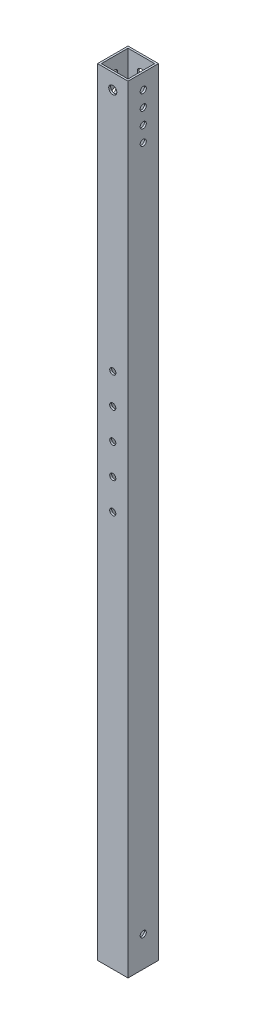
from build123d import *

# Parameters (mm, degrees)
SKETCH1_W                        = 25.4
SKETCH1_H                        = 25.4
SKETCH1_W_2                      = 22.225
SKETCH1_H_2                      = 22.225
BOSS_EXTRUDE1_DEPTH              = 647.7
F_7_0_201_DIAMETER_HOLE1_D       = 5.1054
F_7_0_201_DIAMETER_HOLE2_D       = 5.1054
F_17_64_0_26563_DIAMETER_HOLE1_D = 6.747002


with BuildPart() as part:
    # Sketch1 → Boss-Extrude1 (new body)
    with BuildSketch(Plane(origin=(0, 0, 0), x_dir=(1, 0, 0), z_dir=(0, 1, 0))):
        Rectangle(SKETCH1_W, SKETCH1_H)
        Rectangle(SKETCH1_W_2, SKETCH1_H_2, mode=Mode.SUBTRACT)
    extrude(amount=BOSS_EXTRUDE1_DEPTH)

    # 7 _0.201_ Diameter Hole1 (through all)
    with Locations(Plane.XY.offset(12.7)):
        with Locations((0, 330.2), (0, 355.6), (0, 381), (0, 406.4), (0, 431.8)):
            Hole(F_7_0_201_DIAMETER_HOLE1_D / 2)

    # 7 _0.201_ Diameter Hole2 (through all)
    with Locations(Plane(origin=(12.7, 0, 0), x_dir=(0, 0, -1), z_dir=(1, 0, 0))):
        with Locations((0, 635), (0, 622.3), (0, 609.6), (0, 596.9), (0, 25.4)):
            Hole(F_7_0_201_DIAMETER_HOLE2_D / 2)

    # 17_64 _0.26563_ Diameter Hole1 (through all)
    with Locations(Plane(origin=(0, 0, -12.7), x_dir=(-1, 0, 0), z_dir=(0, 0, -1))):
        with Locations((0, 635)):
            Hole(F_17_64_0_26563_DIAMETER_HOLE1_D / 2)


solid = part.part
